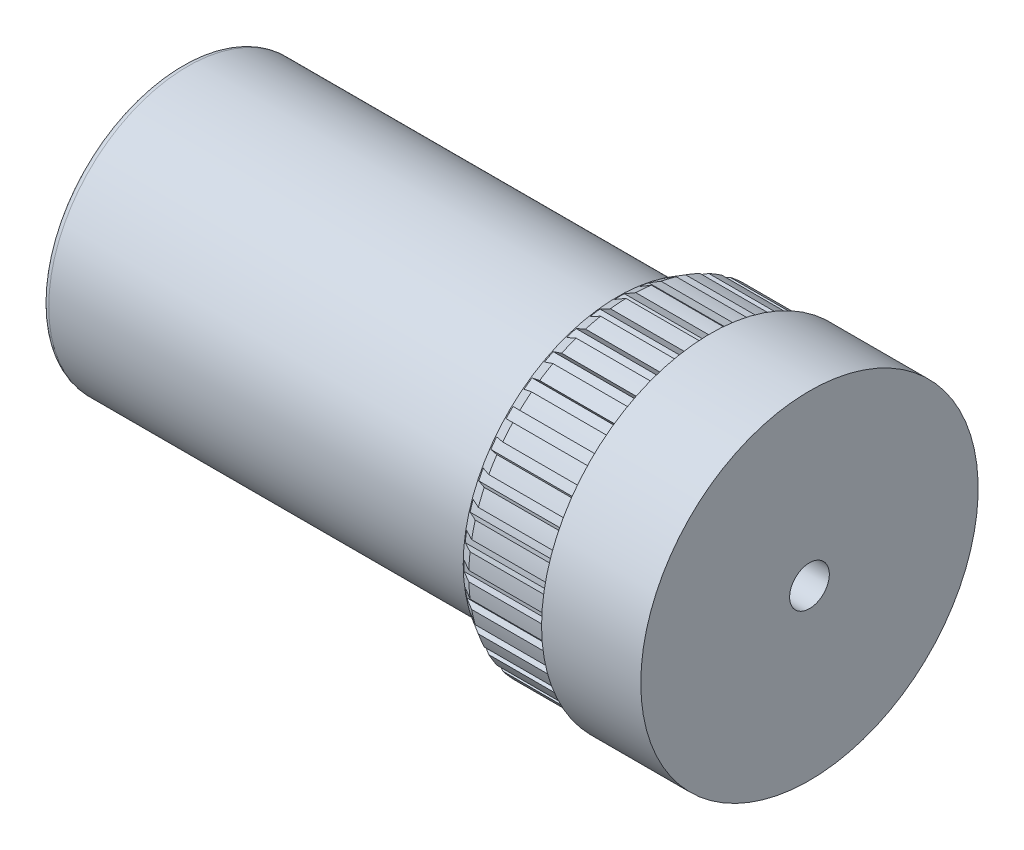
from build123d import *

# Parameters (mm, degrees)
CHANFREIN1_SIZE              = 4
CHANFREIN1_SIZE2             = 2.309401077
ENL_V_MAT_EXTRU_1_REACH      = 152.419
R_P_TITION_CIRCULAIRE1_COUNT = 40


with BuildPart() as part:
    # Esquisse1 → R_volution1 (revolve)
    with BuildSketch(Plane.XY, mode=Mode.PRIVATE) as r_volution1_sk:
        with BuildLine():
            Line((0, 6), (0, 40))
            ThreePointArc((0, 40), (0.585786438, 41.414213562), (2, 42))
            Line((2, 42), (132, 42))
            Line((132, 42), (132, 49))
            Line((132, 49), (160, 49))
            Line((160, 49), (160, 51))
            Line((160, 51), (190, 51))
            Line((190, 51), (190, 6))
            Line((190, 6), (0, 6))
        make_face()
    revolve(r_volution1_sk.sketch.rotate(Axis((0, 0, 0), (1, 0, 0)), 90), axis=Axis((0, 0, 0), (1, 0, 0)))

    # Chanfrein1
    chanfrein1_edges = [part.edges().sort_by_distance(p)[0] for p in [
        (132, 0, -49),
    ]]
    chanfrein1_side = [part.faces().sort_by_distance(p)[0] for p in [
        (146, 0, -49),
    ]]
    chamfer(chanfrein1_edges, length=CHANFREIN1_SIZE, length2=CHANFREIN1_SIZE2, reference=chanfrein1_side[0])

    # Enl_v. mat.-Extru.1: up to this face of the body (flat: up to its plane)
    enl_v_mat_extru_1_end = Plane(part.part.faces().sort_by_distance((160, 0, -50.442497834))[0])
    # Esquisse2 → Enl_v. mat.-Extru.1 (cut, up to the picked face)
    with BuildSketch(Plane.ZY.offset(-132), mode=Mode.PRIVATE) as enl_v_mat_extru_1_sk1:
        with BuildLine():
            Line((-1.5, 48.977035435), (-1.5, 46.976057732))
            ThreePointArc((-1.5, 46.976057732), (0, 47), (1.5, 46.976057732))
            Line((1.5, 46.976057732), (1.5, 48.977035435))
            ThreePointArc((1.5, 48.977035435), (0, 49), (-1.5, 48.977035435))
        make_face()
    enl_v_mat_extru_1_tool1 = split(extrude(enl_v_mat_extru_1_sk1.sketch, amount=-ENL_V_MAT_EXTRU_1_REACH, mode=Mode.PRIVATE), bisect_by=enl_v_mat_extru_1_end, keep=Keep.BOTH, mode=Mode.PRIVATE)
    enl_v_mat_extru_1 = enl_v_mat_extru_1_tool1.solids().sort_by(Axis((132, 47.992182, 0), (1, 0, 0)))[0]
    add(enl_v_mat_extru_1, mode=Mode.SUBTRACT)

    # R_p_tition circulaire1: Enl_v. mat.-Extru.1 ×40 about axis
    r_p_tition_circulaire1_axis = Axis((0, 0, 0), (1, 0, 0))
    for i in range(1, R_P_TITION_CIRCULAIRE1_COUNT):
        add(enl_v_mat_extru_1.rotate(r_p_tition_circulaire1_axis, i * 360 / R_P_TITION_CIRCULAIRE1_COUNT), mode=Mode.SUBTRACT)


solid = part.part
